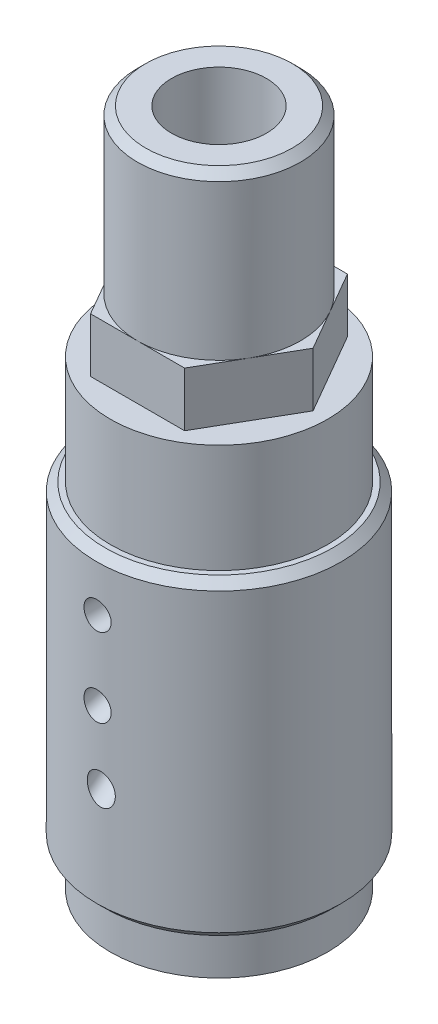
from build123d import *

# Parameters (mm, degrees)
SKIZZE2_R                    = 1.75
LINEAR_AUSTRAGEN1_DEPTH      = 20
LINEAR_START                 = -2
SKIZZE3_R                    = 4
LINEAR_AUSTRAGEN2_DEPTH      = 2
SKIZZE4_W                    = 1
SKIZZE4_H                    = 6
LINEAR_AUSTRAGEN3_DEPTH      = 5
LINEAR_AUSTRAGEN5_REACH      = 27.797
LINEAR_AUSTRAGEN5_END_RADIUS = 4.5
SKIZZE5_R                    = 0.5
LINEAR_AUSTRAGEN6_REACH      = 28.81
LINEAR_AUSTRAGEN6_END_RADIUS = 4.5
LINEAR_START_2               = 1
SKIZZE6_R                    = 0.5
LINEAR_AUSTRAGEN7_REACH      = 30.706
LINEAR_AUSTRAGEN7_END_RADIUS = 4.5
LINEAR_START_3               = 4
SKIZZE7_R                    = 0.5
FASE1_SIZE                   = 0.3


with BuildPart() as part:
    # Skizze1 → Rotation1 (revolve)
    with BuildSketch(Plane.XY, mode=Mode.PRIVATE) as rotation1_sk:
        Polygon((0, 25), (-3, 25), (-3, 19), (-3.5, 19), (-3.5, 17), (-4, 17), (-4, 13), (-4.5, 13), (-4.5, 1.5), (-4, 1.5), (-4, 0), (0, 0), align=None)
    revolve(rotation1_sk.sketch.rotate(Axis((0, 0, 0), (0, 1, 0)), 180), axis=Axis((0, 0, 0), (0, 1, 0)))

    # Skizze2 → Linear austragen1 (cut)
    with BuildSketch(Plane(origin=(0, 25, 0), x_dir=(1, 0, 0), z_dir=(0, 1, 0))):
        with Locations(Location((0, 0, 0), (0, 0, 180))):
            Circle(SKIZZE2_R)
    extrude(amount=-LINEAR_AUSTRAGEN1_DEPTH, mode=Mode.SUBTRACT)

    # Skizze3 → Linear austragen2 (cut)
    with BuildSketch(Plane(origin=(0, 19, 0), x_dir=(1, 0, 0), z_dir=(0, 1, 0)).offset(LINEAR_START)):
        Circle(SKIZZE3_R)
        Polygon((-3.464101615, 0), (-1.732050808, -3), (1.732050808, -3), (3.464101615, 0), (1.732050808, 3), (-1.732050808, 3), align=None, mode=Mode.SUBTRACT)
    extrude(amount=LINEAR_AUSTRAGEN2_DEPTH, mode=Mode.SUBTRACT)

    # Skizze4 → Linear austragen3 (cut)
    with BuildSketch(Plane.XZ):
        Rectangle(SKIZZE4_W, SKIZZE4_H)
    extrude(amount=-LINEAR_AUSTRAGEN3_DEPTH, mode=Mode.SUBTRACT)

    # Linear austragen5: up to this cylinder (the profile starts inside it)
    linear_austragen5_end = Plane(origin=(0, 11, 0), z_dir=(0, -1, 0)) * Cylinder(LINEAR_AUSTRAGEN5_END_RADIUS, 65.594, mode=Mode.PRIVATE)
    # Skizze5 → Linear austragen5 (cut, up to the surface)
    with BuildSketch(Plane.XY, mode=Mode.PRIVATE) as linear_austragen5_sk1:
        with Locations(Location((0, 11, 0), (0, 0, 180))):
            Circle(SKIZZE5_R)
    linear_austragen5_tool1 = extrude(linear_austragen5_sk1.sketch, amount=LINEAR_AUSTRAGEN5_REACH, mode=Mode.PRIVATE) & linear_austragen5_end
    add(linear_austragen5_tool1.solids().sort_by_distance((0, 11, 0))[0], mode=Mode.SUBTRACT)

    # Linear austragen6: up to this cylinder (the profile starts inside it)
    linear_austragen6_end = Plane(origin=(0, 9.573297, 0), z_dir=(0, -1, 0)) * Cylinder(LINEAR_AUSTRAGEN6_END_RADIUS, 67.62, mode=Mode.PRIVATE)
    # Skizze6 → Linear austragen6 (cut, up to the surface)
    with BuildSketch(Plane(origin=(0, 1.138784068, -4.25), x_dir=(1, 0, 0), z_dir=(0, -0.25881904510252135, 0.9659258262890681)).offset(LINEAR_START_2), mode=Mode.PRIVATE) as linear_austragen6_sk1:
        with Locations(Location((0, 9, 0), (0, 0, 90))):
            Circle(SKIZZE6_R)
    linear_austragen6_tool1 = extrude(linear_austragen6_sk1.sketch, amount=LINEAR_AUSTRAGEN6_REACH, mode=Mode.PRIVATE) & linear_austragen6_end
    add(linear_austragen6_tool1.solids().sort_by_distance((0, 9.573297, -0.954703))[0], mode=Mode.SUBTRACT)

    # Linear austragen7: up to this cylinder (the profile starts inside it)
    linear_austragen7_end = Plane(origin=(0, 8.50498, 0), z_dir=(0, -1, 0)) * Cylinder(LINEAR_AUSTRAGEN7_END_RADIUS, 71.412, mode=Mode.PRIVATE)
    # Skizze7 → Linear austragen7 (cut, up to the surface)
    with BuildSketch(Plane(origin=(-0.947693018, 4.279784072, -7.804392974), x_dir=(0.9943795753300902, 0.05090716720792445, -0.09283167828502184), z_dir=(0.1058737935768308, -0.4781263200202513, 0.871886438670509)).offset(LINEAR_START_3), mode=Mode.PRIVATE) as linear_austragen7_sk1:
        with Locations(Location((0, 7, 0), (0, 0, 90))):
            Circle(SKIZZE7_R)
    linear_austragen7_tool1 = extrude(linear_austragen7_sk1.sketch, amount=LINEAR_AUSTRAGEN7_REACH, mode=Mode.PRIVATE) & linear_austragen7_end
    add(linear_austragen7_tool1.solids().sort_by_distance((-0.524198, 8.50498, -0.951046))[0], mode=Mode.SUBTRACT)

    # Fase1
    fase1_edges = [part.edges().sort_by_distance(p)[0] for p in [
        (-4.5, 13, 0),
        (-3, 25, 0),
        (-4.5, 1.5, 0),
    ]]
    chamfer(fase1_edges, length=FASE1_SIZE)


solid = part.part
